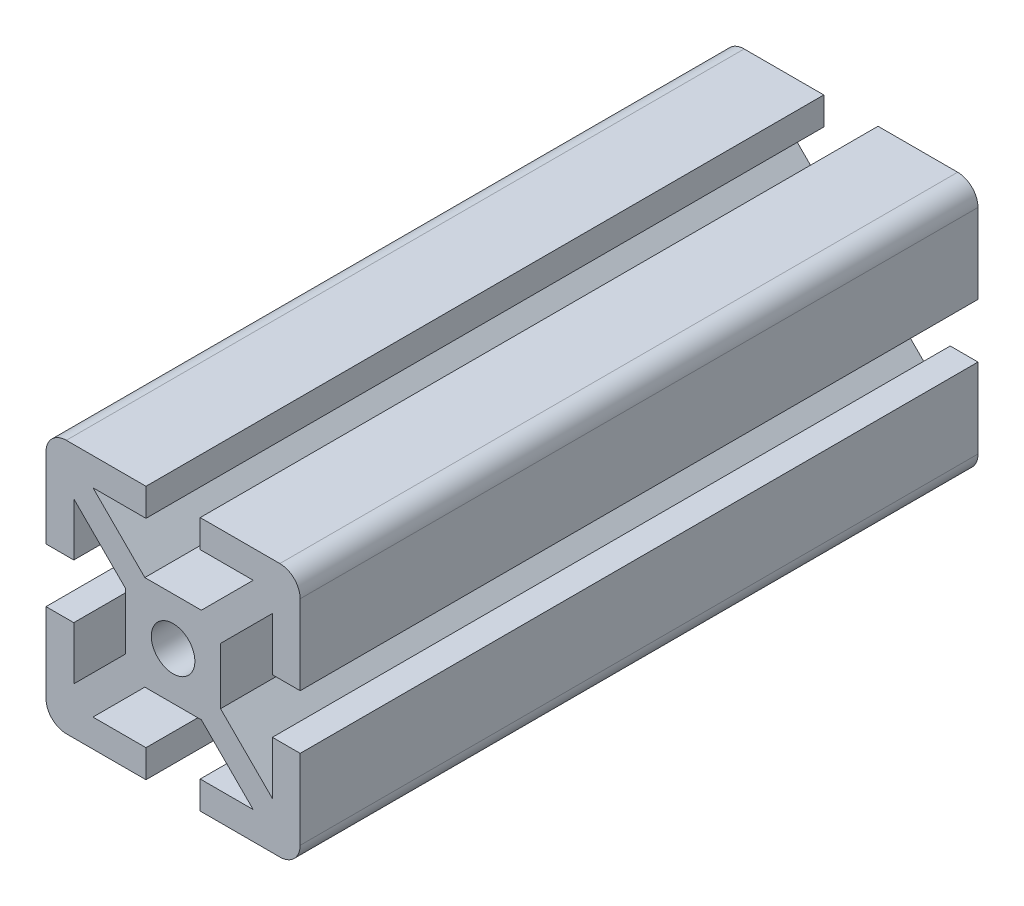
from build123d import *

# Parameters (mm, degrees)
SKETCH1_R      = 3.2639
FINALCUT_DEPTH = 101.6


with BuildPart() as part:
    # Sketch1 → FinalCut (new body)
    with BuildSketch(Plane.XY):
        with BuildLine():
            Line((-7.112, 0), (-7.112, 4.238318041))
            Line((-7.112, 4.238318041), (-14.8844, 12.010718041))
            Line((-14.8844, 12.010718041), (-14.8844, 4.064))
            Line((-14.8844, 4.064), (-19.05, 4.064))
            Line((-19.05, 4.064), (-19.05, 16.002))
            ThreePointArc((-19.05, 16.002), (-18.157261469, 18.157261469), (-16.002, 19.05))
            Line((-16.002, 19.05), (-4.064, 19.05))
            Line((-4.064, 19.05), (-4.064, 14.8844))
            Line((-4.064, 14.8844), (-12.010718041, 14.8844))
            Line((-12.010718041, 14.8844), (-4.238318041, 7.112))
            Line((-4.238318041, 7.112), (0, 7.112))
            Line((0, 7.112), (4.238318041, 7.112))
            Line((4.238318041, 7.112), (12.010718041, 14.8844))
            Line((12.010718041, 14.8844), (4.064, 14.8844))
            Line((4.064, 14.8844), (4.064, 19.05))
            Line((4.064, 19.05), (16.002, 19.05))
            ThreePointArc((16.002, 19.05), (18.157261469, 18.157261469), (19.05, 16.002))
            Line((19.05, 16.002), (19.05, 4.064))
            Line((19.05, 4.064), (14.8844, 4.064))
            Line((14.8844, 4.064), (14.8844, 12.010718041))
            Line((14.8844, 12.010718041), (7.112, 4.238318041))
            Line((7.112, 4.238318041), (7.112, 0))
            Line((7.112, 0), (7.112, -4.238318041))
            Line((7.112, -4.238318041), (14.8844, -12.010718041))
            Line((14.8844, -12.010718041), (14.8844, -4.064))
            Line((14.8844, -4.064), (19.05, -4.064))
            Line((19.05, -4.064), (19.05, -16.002))
            ThreePointArc((19.05, -16.002), (18.157261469, -18.157261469), (16.002, -19.05))
            Line((16.002, -19.05), (4.064, -19.05))
            Line((4.064, -19.05), (4.064, -14.8844))
            Line((4.064, -14.8844), (12.010718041, -14.8844))
            Line((12.010718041, -14.8844), (4.238318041, -7.112))
            Line((4.238318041, -7.112), (0, -7.112))
            Line((0, -7.112), (-4.238318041, -7.112))
            Line((-4.238318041, -7.112), (-12.010718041, -14.8844))
            Line((-12.010718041, -14.8844), (-4.064, -14.8844))
            Line((-4.064, -14.8844), (-4.064, -19.05))
            Line((-4.064, -19.05), (-16.002, -19.05))
            ThreePointArc((-16.002, -19.05), (-18.157261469, -18.157261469), (-19.05, -16.002))
            Line((-19.05, -16.002), (-19.05, -4.064))
            Line((-19.05, -4.064), (-14.8844, -4.064))
            Line((-14.8844, -4.064), (-14.8844, -12.010718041))
            Line((-14.8844, -12.010718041), (-7.112, -4.238318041))
            Line((-7.112, -4.238318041), (-7.112, 0))
        make_face()
        Circle(SKETCH1_R, mode=Mode.SUBTRACT)
    extrude(amount=-FINALCUT_DEPTH)


solid = part.part
